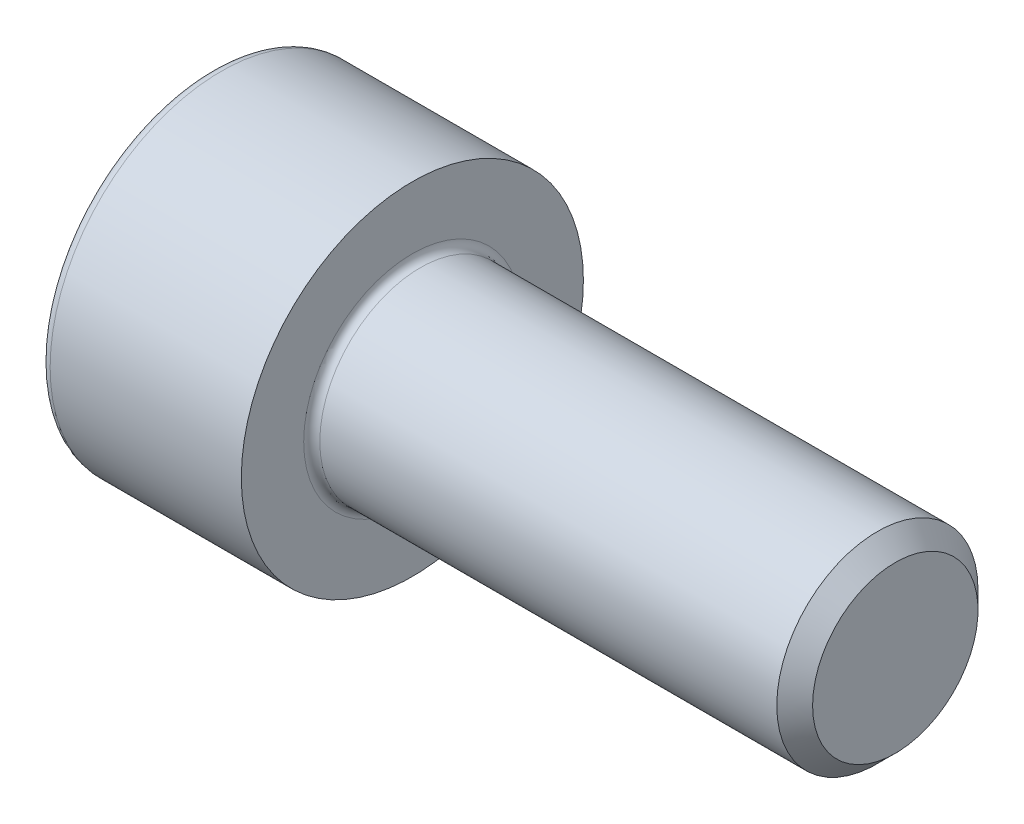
from build123d import *

# Parameters (mm, degrees)
FILLET1_R   = 0.2
FILLET2_R   = 0.25
HEX_2_DEPTH = 2.5


with BuildPart() as part:
    # BodySke → Base-Revolve (revolve)
    with BuildSketch(Plane.XY, mode=Mode.PRIVATE) as base_revolve_sk:
        Polygon((0, 0), (0, 4.25), (5, 4.25), (5, 2.5), (16.555, 2.5), (17, 2.055), (17, 0), align=None)
    revolve(base_revolve_sk.sketch.rotate(Axis((-31.75, 0, 0), (1, 0, 0)), 90), axis=Axis((-31.75, 0, 0), (1, 0, 0)))

    # Fillet1
    fillet1_edges = [part.edges().sort_by_distance(p)[0] for p in [
        (5, 0, -2.5),
    ]]
    fillet(fillet1_edges, radius=FILLET1_R)

    # Fillet2
    fillet2_edges = [part.edges().sort_by_distance(p)[0] for p in [
        (0, 0, -4.25),
    ]]
    fillet(fillet2_edges, radius=FILLET2_R)

    # Sketch2 → Hex-PreBroach (revolve, cut)
    with BuildSketch(Plane.XY, mode=Mode.PRIVATE) as hex_prebroach_sk:
        Polygon((0, 2.042), (2.5, 2.042), (3.67894925, 0), (0, 0), align=None)
    revolve(hex_prebroach_sk.sketch.rotate(Axis((0, 0, 0), (1, 0, 0)), 90), axis=Axis((0, 0, 0), (1, 0, 0)), mode=Mode.SUBTRACT)

    # Sketch3 → Hex 2 (cut)
    with BuildSketch(Plane(origin=(0, 0, 0), x_dir=(0, 0.500000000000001, 0.866025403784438), z_dir=(-1, 0, 0))):
        Polygon((1.17894925, 2.042), (-1.17894925, 2.042), (-2.357898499, 0), (-1.17894925, -2.042), (1.17894925, -2.042), (2.357898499, 0), align=None)
    extrude(amount=-HEX_2_DEPTH, mode=Mode.SUBTRACT)


solid = part.part
